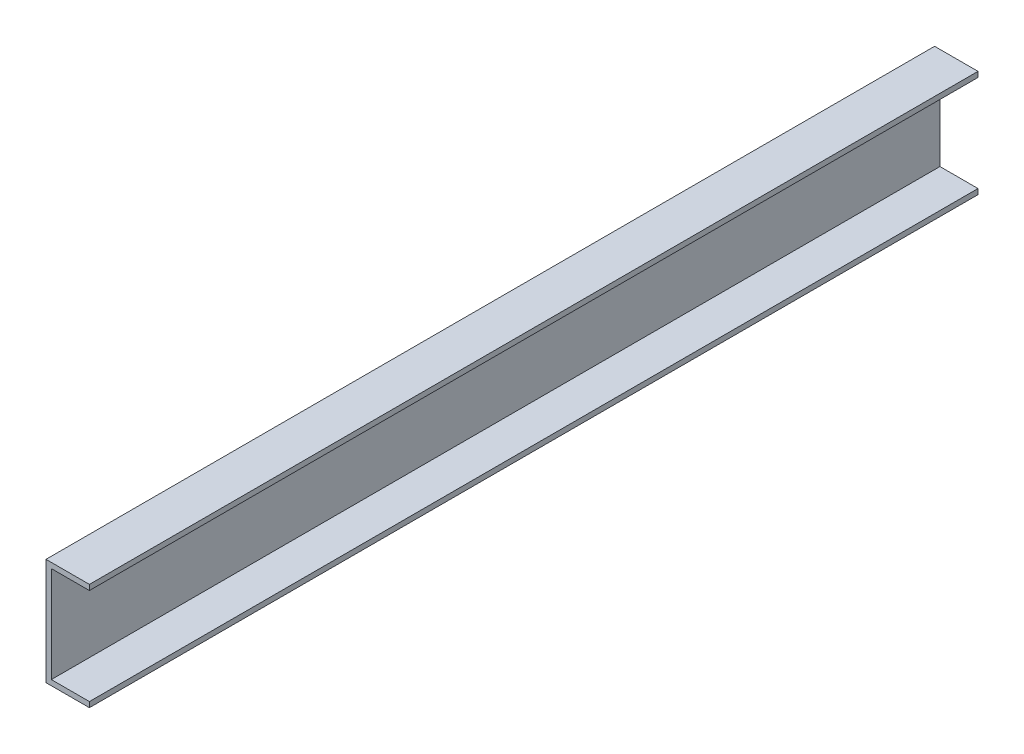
from build123d import *

# Parameters (mm, degrees)
BOSS_EXTRUDE1_DEPTH = 1331


with BuildPart() as part:
    # Sketch1 → Boss-Extrude1 (new body)
    with BuildSketch(Plane.XY):
        Polygon((65, 0), (0, 0), (0, 160), (65, 160), (65, 152), (8, 152), (8, 8), (65, 8), align=None)
    extrude(amount=BOSS_EXTRUDE1_DEPTH)


solid = part.part
